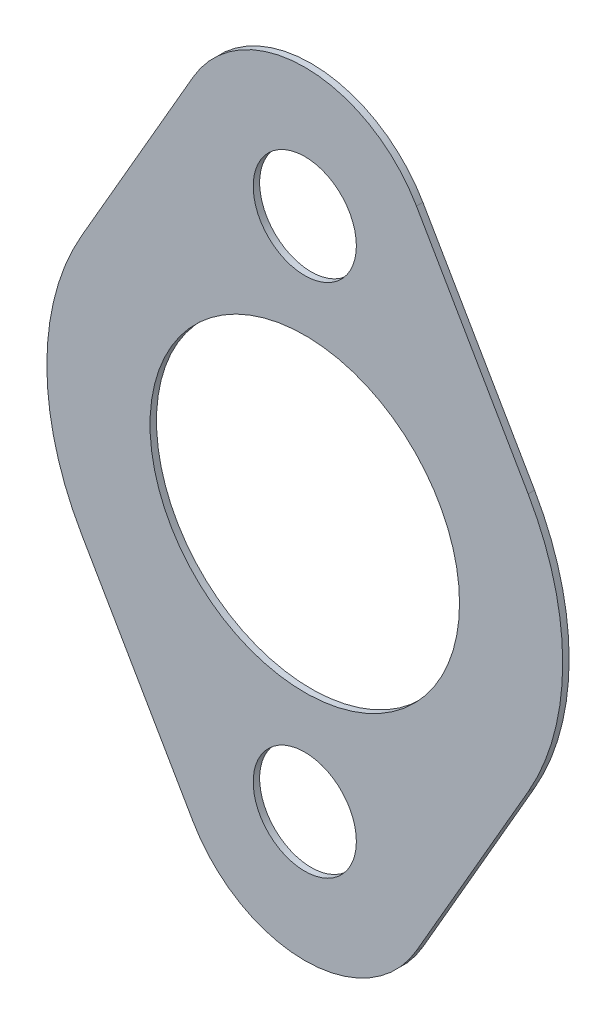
from build123d import *

# Parameters (mm, degrees)
MAIN_DEPTH  = 1.5875
SKETCH2_R   = 12.7
SKETCH2_R_2 = 38.1
HOLES_DEPTH = 115.487259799


with BuildPart() as part:
    # Sketch1 → Main (new body)
    with BuildSketch(Plane.XY):
        with BuildLine():
            Line((27.49630657, 79.375), (54.99261314, 31.75))
            ThreePointArc((54.99261314, 31.75), (63.5, 0), (54.99261314, -31.75))
            Line((54.99261314, -31.75), (27.49630657, -79.375))
            ThreePointArc((27.49630657, -79.375), (0, -95.25), (-27.49630657, -79.375))
            Line((-27.49630657, -79.375), (-54.99261314, -31.75))
            ThreePointArc((-54.99261314, -31.75), (-63.5, 0), (-54.99261314, 31.75))
            Line((-54.99261314, 31.75), (-27.49630657, 79.375))
            ThreePointArc((-27.49630657, 79.375), (0, 95.25), (27.49630657, 79.375))
        make_face()
    extrude(amount=MAIN_DEPTH)

    # Sketch2 → Holes (cut, through all)
    with BuildSketch(Plane.XY.offset(1.5875)):
        with Locations((0, 63.5)):
            Circle(SKETCH2_R)
        with Locations((0, -63.5)):
            Circle(SKETCH2_R)
        Circle(SKETCH2_R_2)
    extrude(amount=-HOLES_DEPTH, mode=Mode.SUBTRACT)


solid = part.part
